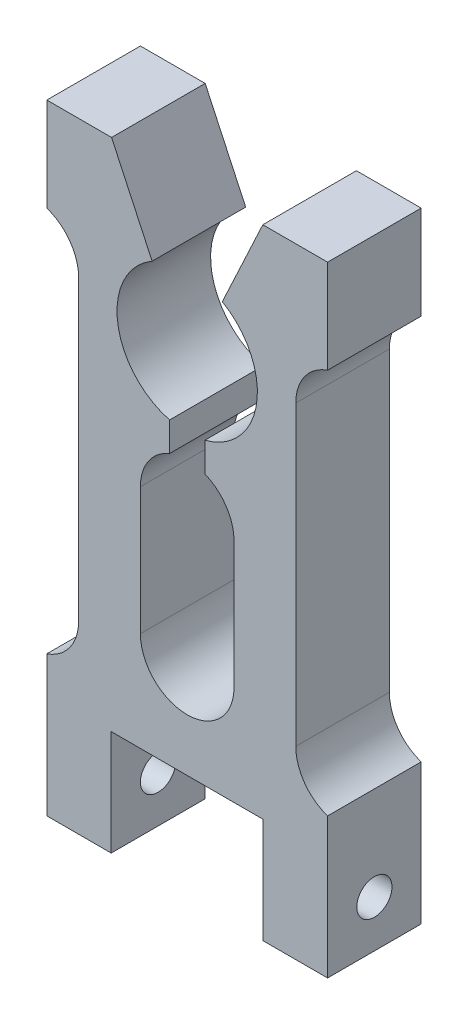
from build123d import *

# Parameters (mm, degrees)
BOSS_EXTRUDE1_DEPTH = 6.35
SKETCH4_R           = 2.3876
CUT_EXTRUDE2_DEPTH  = 38.1


with BuildPart() as part:
    # Sketch2 → Boss-Extrude1 (new, symmetric)
    with BuildSketch(Plane.XY):
        with BuildLine():
            Line((-10.3124, -49.8094), (10.3124, -49.8094))
            Line((10.3124, -49.8094), (10.3124, -64.0842))
            Line((10.3124, -64.0842), (19.05, -64.0842))
            Line((19.05, -64.0842), (19.05, -45.0342))
            ThreePointArc((19.05, -45.0342), (15.923235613, -42.720753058), (14.732, -39.018098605))
            Line((14.732, -39.018098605), (14.732, 1.324498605))
            ThreePointArc((14.732, 1.324498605), (15.923235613, 5.027153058), (19.05, 7.3406))
            Line((19.05, 7.3406), (19.05, 20.0406))
            Line((19.05, 20.0406), (10.261063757, 20.0406))
            Line((10.261063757, 20.0406), (4.7625, 8.248891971))
            ThreePointArc((4.7625, 8.248891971), (9.438187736, -1.283057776), (2.3876, -9.220899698))
            Line((2.3876, -9.220899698), (2.3876, -13.165965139))
            ThreePointArc((2.3876, -13.165965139), (5.267056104, -15.503083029), (6.35, -19.05))
            Line((6.35, -19.05), (6.35, -36.322))
            ThreePointArc((6.35, -36.322), (0, -42.672), (-6.35, -36.322))
            Line((-6.35, -36.322), (-6.35, -19.05))
            ThreePointArc((-6.35, -19.05), (-5.267056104, -15.503083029), (-2.3876, -13.165965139))
            Line((-2.3876, -13.165965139), (-2.3876, -9.220899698))
            ThreePointArc((-2.3876, -9.220899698), (-9.438187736, -1.283057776), (-4.7625, 8.248891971))
            Line((-4.7625, 8.248891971), (-10.261063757, 20.0406))
            Line((-10.261063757, 20.0406), (-19.05, 20.0406))
            Line((-19.05, 20.0406), (-19.05, 7.3406))
            ThreePointArc((-19.05, 7.3406), (-15.923235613, 5.027153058), (-14.732, 1.324498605))
            Line((-14.732, 1.324498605), (-14.732, -39.018098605))
            ThreePointArc((-14.732, -39.018098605), (-15.923235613, -42.720753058), (-19.05, -45.0342))
            Line((-19.05, -45.0342), (-19.05, -64.0842))
            Line((-19.05, -64.0842), (-10.3124, -64.0842))
            Line((-10.3124, -64.0842), (-10.3124, -49.8094))
        make_face()
    extrude(amount=BOSS_EXTRUDE1_DEPTH, both=True)

    # Sketch4 → Cut-Extrude2 (cut, symmetric)
    with BuildSketch(Plane(origin=(0, 0, 0), x_dir=(0, 0, -1), z_dir=(1, 0, 0))):
        with Locations((0, -57.7342)):
            Circle(SKETCH4_R)
    extrude(amount=CUT_EXTRUDE2_DEPTH, both=True, mode=Mode.SUBTRACT)


solid = part.part
